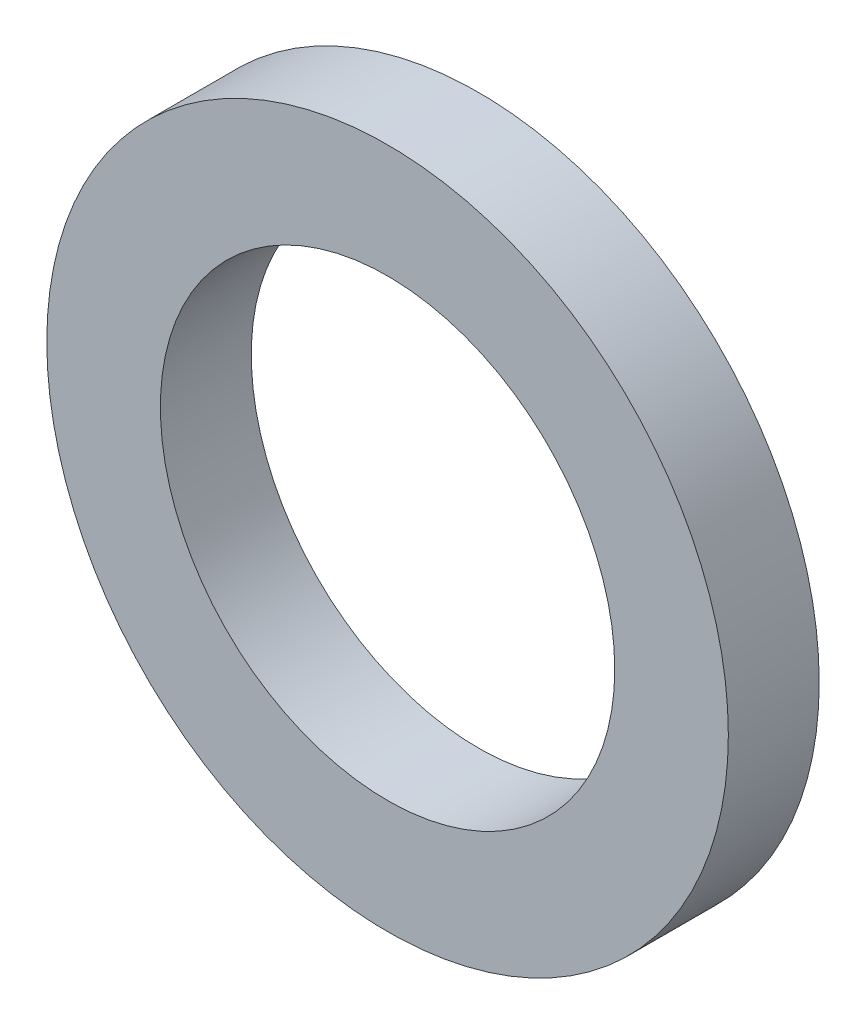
from build123d import *

# Parameters (mm, degrees)
ESQUISSE1_W = 2
ESQUISSE1_H = 2.5


with BuildPart() as part:
    # Esquisse1 → Base-R_volution (revolve)
    with BuildSketch(Plane(origin=(0, 0, 0), x_dir=(0, 0, -1), z_dir=(1, 0, 0)), mode=Mode.PRIVATE) as base_r_volution_sk:
        with Locations((1, 6.25)):
            Rectangle(ESQUISSE1_W, ESQUISSE1_H)
    revolve(base_r_volution_sk.sketch.rotate(Axis((0, 0, 0), (0, 0, -1)), 90), axis=Axis((0, 0, 0), (0, 0, -1)))


solid = part.part
